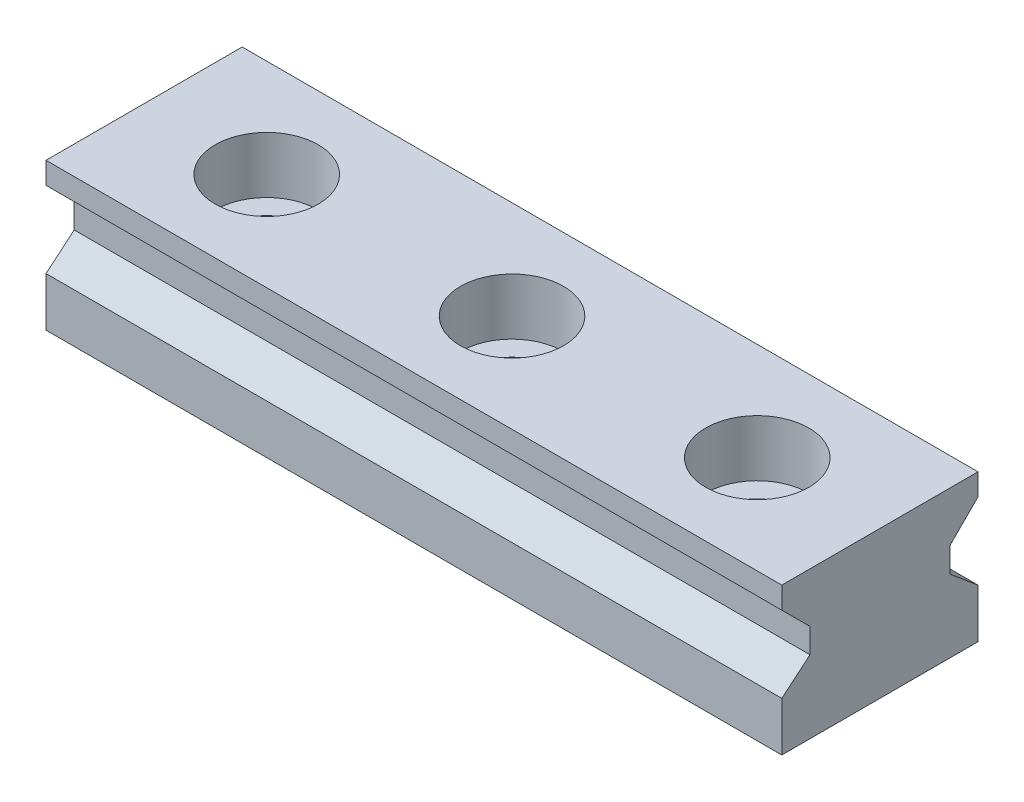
ISO-10303-21;
HEADER;
FILE_DESCRIPTION(('STEP AP214'),'2;1');
FILE_NAME('part.step','',(''),(''),'','','');
FILE_SCHEMA(('AUTOMOTIVE_DESIGN { 1 0 10303 214 1 1 1 1 }'));
ENDSEC;
DATA;
#1=APPLICATION_CONTEXT('core data for automotive mechanical design processes');
#2=APPLICATION_PROTOCOL_DEFINITION('international standard','automotive_design',2000,#1);
#3=PRODUCT_CONTEXT('',#1,'mechanical');
#4=PRODUCT('Part','Part','',(#3));
#5=PRODUCT_RELATED_PRODUCT_CATEGORY('part','',(#4));
#6=PRODUCT_DEFINITION_FORMATION('','',#4);
#7=PRODUCT_DEFINITION_CONTEXT('part definition',#1,'design');
#8=PRODUCT_DEFINITION('design','',#6,#7);
#9=PRODUCT_DEFINITION_SHAPE('','',#8);
#10=(LENGTH_UNIT() NAMED_UNIT(*) SI_UNIT(.MILLI.,.METRE.));
#11=(NAMED_UNIT(*) PLANE_ANGLE_UNIT() SI_UNIT($,.RADIAN.));
#12=(NAMED_UNIT(*) SI_UNIT($,.STERADIAN.) SOLID_ANGLE_UNIT());
#13=UNCERTAINTY_MEASURE_WITH_UNIT(LENGTH_MEASURE(1.E-05),#10,'distance_accuracy_value','');
#14=(GEOMETRIC_REPRESENTATION_CONTEXT(3) GLOBAL_UNCERTAINTY_ASSIGNED_CONTEXT((#13)) GLOBAL_UNIT_ASSIGNED_CONTEXT((#10,
#11,#12)) REPRESENTATION_CONTEXT('',''));
#15=CARTESIAN_POINT('',(0.,0.,0.));
#16=DIRECTION('',(0.,0.,1.));
#17=DIRECTION('',(1.,0.,0.));
#18=AXIS2_PLACEMENT_3D('',#15,#16,#17);
#19=CARTESIAN_POINT('',(-15.,5.114964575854,4.));
#20=DIRECTION('',(0.,-0.707106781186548,0.707106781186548));
#21=DIRECTION('',(0.,-0.707106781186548,-0.707106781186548));
#22=AXIS2_PLACEMENT_3D('',#19,#20,#21);
#23=PLANE('',#22);
#24=DIRECTION('',(1.,0.,0.));
#25=VECTOR('',#24,1.);
#26=CARTESIAN_POINT('',(-15.,5.114964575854,4.));
#27=LINE('',#26,#25);
#28=CARTESIAN_POINT('',(-15.,5.114964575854,4.));
#29=VERTEX_POINT('',#28);
#30=CARTESIAN_POINT('',(15.,5.114964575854,4.));
#31=VERTEX_POINT('',#30);
#32=EDGE_CURVE('E209',#29,#31,#27,.T.);
#33=ORIENTED_EDGE('',*,*,#32,.F.);
#34=DIRECTION('',(0.,-0.707106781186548,-0.707106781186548));
#35=VECTOR('',#34,1.);
#36=CARTESIAN_POINT('',(-15.,5.114964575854,4.));
#37=LINE('',#36,#35);
#38=CARTESIAN_POINT('',(-15.,3.964964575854,2.85));
#39=VERTEX_POINT('',#38);
#40=EDGE_CURVE('E117',#29,#39,#37,.T.);
#41=ORIENTED_EDGE('',*,*,#40,.T.);
#42=DIRECTION('',(1.,0.,0.));
#43=VECTOR('',#42,1.);
#44=CARTESIAN_POINT('',(-15.,3.964964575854,2.85));
#45=LINE('',#44,#43);
#46=CARTESIAN_POINT('',(15.,3.964964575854,2.85));
#47=VERTEX_POINT('',#46);
#48=EDGE_CURVE('E214',#47,#39,#45,.F.);
#49=ORIENTED_EDGE('',*,*,#48,.F.);
#50=DIRECTION('',(0.,-0.707106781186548,-0.707106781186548));
#51=VECTOR('',#50,1.);
#52=CARTESIAN_POINT('',(15.,5.114964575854,4.));
#53=LINE('',#52,#51);
#54=EDGE_CURVE('E136',#47,#31,#53,.F.);
#55=ORIENTED_EDGE('',*,*,#54,.T.);
#56=EDGE_LOOP('',(#33,#41,#49,#55));
#57=FACE_BOUND('',#56,.T.);
#58=ADVANCED_FACE('F16',(#57),#23,.T.);
#59=CARTESIAN_POINT('',(-15.,3.964964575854,-2.85));
#60=DIRECTION('',(0.,-0.707106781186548,-0.707106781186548));
#61=DIRECTION('',(0.,0.707106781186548,-0.707106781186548));
#62=AXIS2_PLACEMENT_3D('',#59,#60,#61);
#63=PLANE('',#62);
#64=DIRECTION('',(-1.,0.,0.));
#65=VECTOR('',#64,1.);
#66=CARTESIAN_POINT('',(-15.,3.964964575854,-2.85));
#67=LINE('',#66,#65);
#68=CARTESIAN_POINT('',(-15.,3.964964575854,-2.85));
#69=VERTEX_POINT('',#68);
#70=CARTESIAN_POINT('',(15.,3.964964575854,-2.85));
#71=VERTEX_POINT('',#70);
#72=EDGE_CURVE('E111',#69,#71,#67,.F.);
#73=ORIENTED_EDGE('',*,*,#72,.F.);
#74=DIRECTION('',(0.,0.707106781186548,-0.707106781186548));
#75=VECTOR('',#74,1.);
#76=CARTESIAN_POINT('',(-15.,3.964964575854,-2.85));
#77=LINE('',#76,#75);
#78=CARTESIAN_POINT('',(-15.,5.114964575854,-4.));
#79=VERTEX_POINT('',#78);
#80=EDGE_CURVE('E102',#69,#79,#77,.T.);
#81=ORIENTED_EDGE('',*,*,#80,.T.);
#82=DIRECTION('',(-1.,0.,0.));
#83=VECTOR('',#82,1.);
#84=CARTESIAN_POINT('',(-15.,5.114964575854,-4.));
#85=LINE('',#84,#83);
#86=CARTESIAN_POINT('',(15.,5.114964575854,-4.));
#87=VERTEX_POINT('',#86);
#88=EDGE_CURVE('E114',#87,#79,#85,.T.);
#89=ORIENTED_EDGE('',*,*,#88,.F.);
#90=DIRECTION('',(0.,0.707106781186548,-0.707106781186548));
#91=VECTOR('',#90,1.);
#92=CARTESIAN_POINT('',(15.,3.964964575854,-2.85));
#93=LINE('',#92,#91);
#94=EDGE_CURVE('E107',#87,#71,#93,.F.);
#95=ORIENTED_EDGE('',*,*,#94,.T.);
#96=EDGE_LOOP('',(#73,#81,#89,#95));
#97=FACE_BOUND('',#96,.T.);
#98=ADVANCED_FACE('F109',(#97),#63,.T.);
#99=CARTESIAN_POINT('',(-15.,2.964964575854,-2.85));
#100=DIRECTION('',(0.,0.,-1.));
#101=DIRECTION('',(-1.,0.,0.));
#102=AXIS2_PLACEMENT_3D('',#99,#100,#101);
#103=PLANE('',#102);
#104=DIRECTION('',(1.,0.,0.));
#105=VECTOR('',#104,1.);
#106=CARTESIAN_POINT('',(-15.,2.96496457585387,-2.84999999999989));
#107=LINE('',#106,#105);
#108=CARTESIAN_POINT('',(-15.,2.96496457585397,-2.84999999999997));
#109=VERTEX_POINT('',#108);
#110=CARTESIAN_POINT('',(15.,2.96496457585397,-2.84999999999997));
#111=VERTEX_POINT('',#110);
#112=EDGE_CURVE('E197',#109,#111,#107,.T.);
#113=ORIENTED_EDGE('',*,*,#112,.F.);
#114=DIRECTION('',(0.,1.,0.));
#115=VECTOR('',#114,1.);
#116=CARTESIAN_POINT('',(-15.,2.964964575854,-2.85));
#117=LINE('',#116,#115);
#118=EDGE_CURVE('E128',#109,#69,#117,.T.);
#119=ORIENTED_EDGE('',*,*,#118,.T.);
#120=ORIENTED_EDGE('',*,*,#72,.T.);
#121=DIRECTION('',(0.,1.,0.));
#122=VECTOR('',#121,1.);
#123=CARTESIAN_POINT('',(15.,2.964964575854,-2.85));
#124=LINE('',#123,#122);
#125=EDGE_CURVE('E120',#71,#111,#124,.F.);
#126=ORIENTED_EDGE('',*,*,#125,.T.);
#127=EDGE_LOOP('',(#113,#119,#120,#126));
#128=FACE_BOUND('',#127,.T.);
#129=ADVANCED_FACE('F130',(#128),#103,.T.);
#130=CARTESIAN_POINT('',(-15.,3.964964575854,2.85));
#131=DIRECTION('',(0.,0.,1.));
#132=DIRECTION('',(1.,0.,0.));
#133=AXIS2_PLACEMENT_3D('',#130,#131,#132);
#134=PLANE('',#133);
#135=ORIENTED_EDGE('',*,*,#48,.T.);
#136=DIRECTION('',(0.,1.,0.));
#137=VECTOR('',#136,1.);
#138=CARTESIAN_POINT('',(-15.,3.964964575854,2.85));
#139=LINE('',#138,#137);
#140=CARTESIAN_POINT('',(-15.,2.964964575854,2.85));
#141=VERTEX_POINT('',#140);
#142=EDGE_CURVE('E212',#39,#141,#139,.F.);
#143=ORIENTED_EDGE('',*,*,#142,.T.);
#144=DIRECTION('',(1.,0.,0.));
#145=VECTOR('',#144,1.);
#146=CARTESIAN_POINT('',(-15.,2.964964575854,2.85));
#147=LINE('',#146,#145);
#148=CARTESIAN_POINT('',(15.,2.964964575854,2.85));
#149=VERTEX_POINT('',#148);
#150=EDGE_CURVE('E190',#149,#141,#147,.F.);
#151=ORIENTED_EDGE('',*,*,#150,.F.);
#152=DIRECTION('',(0.,1.,0.));
#153=VECTOR('',#152,1.);
#154=CARTESIAN_POINT('',(15.,3.964964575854,2.85));
#155=LINE('',#154,#153);
#156=EDGE_CURVE('E217',#149,#47,#155,.T.);
#157=ORIENTED_EDGE('',*,*,#156,.T.);
#158=EDGE_LOOP('',(#135,#143,#151,#157));
#159=FACE_BOUND('',#158,.T.);
#160=ADVANCED_FACE('F221',(#159),#134,.T.);
#161=CARTESIAN_POINT('',(-15.,6.,4.));
#162=DIRECTION('',(0.,0.,1.));
#163=DIRECTION('',(1.,0.,0.));
#164=AXIS2_PLACEMENT_3D('',#161,#162,#163);
#165=PLANE('',#164);
#166=DIRECTION('',(1.,0.,0.));
#167=VECTOR('',#166,1.);
#168=CARTESIAN_POINT('',(-15.,6.,4.));
#169=LINE('',#168,#167);
#170=CARTESIAN_POINT('',(-15.,6.,4.));
#171=VERTEX_POINT('',#170);
#172=CARTESIAN_POINT('',(15.,6.,4.));
#173=VERTEX_POINT('',#172);
#174=EDGE_CURVE('E176',#171,#173,#169,.T.);
#175=ORIENTED_EDGE('',*,*,#174,.F.);
#176=DIRECTION('',(0.,1.,0.));
#177=VECTOR('',#176,1.);
#178=CARTESIAN_POINT('',(-15.,6.,4.));
#179=LINE('',#178,#177);
#180=EDGE_CURVE('E204',#171,#29,#179,.F.);
#181=ORIENTED_EDGE('',*,*,#180,.T.);
#182=ORIENTED_EDGE('',*,*,#32,.T.);
#183=DIRECTION('',(0.,1.,0.));
#184=VECTOR('',#183,1.);
#185=CARTESIAN_POINT('',(15.,6.,4.));
#186=LINE('',#185,#184);
#187=EDGE_CURVE('E207',#31,#173,#186,.T.);
#188=ORIENTED_EDGE('',*,*,#187,.T.);
#189=EDGE_LOOP('',(#175,#181,#182,#188));
#190=FACE_BOUND('',#189,.T.);
#191=ADVANCED_FACE('F322',(#190),#165,.T.);
#192=CARTESIAN_POINT('',(-15.,5.114964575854,-4.));
#193=DIRECTION('',(0.,0.,-1.));
#194=DIRECTION('',(-1.,0.,0.));
#195=AXIS2_PLACEMENT_3D('',#192,#193,#194);
#196=PLANE('',#195);
#197=ORIENTED_EDGE('',*,*,#88,.T.);
#198=DIRECTION('',(0.,1.,0.));
#199=VECTOR('',#198,1.);
#200=CARTESIAN_POINT('',(-15.,5.114964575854,-4.));
#201=LINE('',#200,#199);
#202=CARTESIAN_POINT('',(-15.,6.,-4.));
#203=VERTEX_POINT('',#202);
#204=EDGE_CURVE('E199',#79,#203,#201,.T.);
#205=ORIENTED_EDGE('',*,*,#204,.T.);
#206=DIRECTION('',(1.,0.,0.));
#207=VECTOR('',#206,1.);
#208=CARTESIAN_POINT('',(-15.,6.,-4.));
#209=LINE('',#208,#207);
#210=CARTESIAN_POINT('',(15.,6.,-4.));
#211=VERTEX_POINT('',#210);
#212=EDGE_CURVE('E172',#211,#203,#209,.F.);
#213=ORIENTED_EDGE('',*,*,#212,.F.);
#214=DIRECTION('',(0.,1.,0.));
#215=VECTOR('',#214,1.);
#216=CARTESIAN_POINT('',(15.,5.114964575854,-4.));
#217=LINE('',#216,#215);
#218=EDGE_CURVE('E202',#211,#87,#217,.F.);
#219=ORIENTED_EDGE('',*,*,#218,.T.);
#220=EDGE_LOOP('',(#197,#205,#213,#219));
#221=FACE_BOUND('',#220,.T.);
#222=ADVANCED_FACE('F313',(#221),#196,.T.);
#223=CARTESIAN_POINT('',(10.,-0.3,0.));
#224=DIRECTION('',(0.,1.,0.));
#225=DIRECTION('',(0.,0.,1.));
#226=AXIS2_PLACEMENT_3D('',#223,#224,#225);
#227=CYLINDRICAL_SURFACE('',#226,2.1);
#228=CARTESIAN_POINT('',(10.,3.7,0.));
#229=DIRECTION('',(0.,1.,0.));
#230=DIRECTION('',(0.,0.,1.));
#231=AXIS2_PLACEMENT_3D('',#228,#229,#230);
#232=CIRCLE('',#231,2.1);
#233=CARTESIAN_POINT('',(10.,3.7,2.1));
#234=VERTEX_POINT('',#233);
#235=EDGE_CURVE('E162',#234,#234,#232,.T.);
#236=ORIENTED_EDGE('',*,*,#235,.F.);
#237=EDGE_LOOP('',(#236));
#238=FACE_BOUND('',#237,.T.);
#239=CARTESIAN_POINT('',(10.,6.,0.));
#240=DIRECTION('',(0.,1.,0.));
#241=DIRECTION('',(0.,0.,1.));
#242=AXIS2_PLACEMENT_3D('',#239,#240,#241);
#243=CIRCLE('',#242,2.1);
#244=CARTESIAN_POINT('',(10.,6.,2.1));
#245=VERTEX_POINT('',#244);
#246=EDGE_CURVE('E19',#245,#245,#243,.F.);
#247=ORIENTED_EDGE('',*,*,#246,.F.);
#248=EDGE_LOOP('',(#247));
#249=FACE_BOUND('',#248,.T.);
#250=ADVANCED_FACE('F309',(#238,#249),#227,.F.);
#251=CARTESIAN_POINT('',(0.,-0.3,0.));
#252=DIRECTION('',(0.,1.,0.));
#253=DIRECTION('',(0.,0.,1.));
#254=AXIS2_PLACEMENT_3D('',#251,#252,#253);
#255=CYLINDRICAL_SURFACE('',#254,2.1);
#256=CARTESIAN_POINT('',(0.,3.7,0.));
#257=DIRECTION('',(0.,1.,0.));
#258=DIRECTION('',(0.,0.,1.));
#259=AXIS2_PLACEMENT_3D('',#256,#257,#258);
#260=CIRCLE('',#259,2.1);
#261=CARTESIAN_POINT('',(0.,3.7,2.1));
#262=VERTEX_POINT('',#261);
#263=EDGE_CURVE('E159',#262,#262,#260,.T.);
#264=ORIENTED_EDGE('',*,*,#263,.F.);
#265=EDGE_LOOP('',(#264));
#266=FACE_BOUND('',#265,.T.);
#267=CARTESIAN_POINT('',(0.,6.,0.));
#268=DIRECTION('',(0.,1.,0.));
#269=DIRECTION('',(0.,0.,1.));
#270=AXIS2_PLACEMENT_3D('',#267,#268,#269);
#271=CIRCLE('',#270,2.1);
#272=CARTESIAN_POINT('',(0.,6.,2.1));
#273=VERTEX_POINT('',#272);
#274=EDGE_CURVE('E167',#273,#273,#271,.F.);
#275=ORIENTED_EDGE('',*,*,#274,.F.);
#276=EDGE_LOOP('',(#275));
#277=FACE_BOUND('',#276,.T.);
#278=ADVANCED_FACE('F312',(#266,#277),#255,.F.);
#279=CARTESIAN_POINT('',(-10.,-0.3,0.));
#280=DIRECTION('',(0.,1.,0.));
#281=DIRECTION('',(0.,0.,1.));
#282=AXIS2_PLACEMENT_3D('',#279,#280,#281);
#283=CYLINDRICAL_SURFACE('',#282,2.1);
#284=CARTESIAN_POINT('',(-10.,3.7,0.));
#285=DIRECTION('',(0.,1.,0.));
#286=DIRECTION('',(0.,0.,1.));
#287=AXIS2_PLACEMENT_3D('',#284,#285,#286);
#288=CIRCLE('',#287,2.1);
#289=CARTESIAN_POINT('',(-10.,3.7,2.1));
#290=VERTEX_POINT('',#289);
#291=EDGE_CURVE('E155',#290,#290,#288,.T.);
#292=ORIENTED_EDGE('',*,*,#291,.F.);
#293=EDGE_LOOP('',(#292));
#294=FACE_BOUND('',#293,.T.);
#295=CARTESIAN_POINT('',(-10.,6.,0.));
#296=DIRECTION('',(0.,1.,0.));
#297=DIRECTION('',(0.,0.,1.));
#298=AXIS2_PLACEMENT_3D('',#295,#296,#297);
#299=CIRCLE('',#298,2.1);
#300=CARTESIAN_POINT('',(-10.,6.,2.1));
#301=VERTEX_POINT('',#300);
#302=EDGE_CURVE('E165',#301,#301,#299,.F.);
#303=ORIENTED_EDGE('',*,*,#302,.F.);
#304=EDGE_LOOP('',(#303));
#305=FACE_BOUND('',#304,.T.);
#306=ADVANCED_FACE('F319',(#294,#305),#283,.F.);
#307=CARTESIAN_POINT('',(-15.,2.,-4.));
#308=DIRECTION('',(0.,0.766044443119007,-0.642787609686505));
#309=DIRECTION('',(0.,0.642787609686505,0.766044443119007));
#310=AXIS2_PLACEMENT_3D('',#307,#308,#309);
#311=PLANE('',#310);
#312=DIRECTION('',(-1.,0.,0.));
#313=VECTOR('',#312,1.);
#314=CARTESIAN_POINT('',(-15.,2.,-4.));
#315=LINE('',#314,#313);
#316=CARTESIAN_POINT('',(-15.,2.,-4.));
#317=VERTEX_POINT('',#316);
#318=CARTESIAN_POINT('',(15.,2.,-4.));
#319=VERTEX_POINT('',#318);
#320=EDGE_CURVE('E158',#317,#319,#315,.F.);
#321=ORIENTED_EDGE('',*,*,#320,.F.);
#322=DIRECTION('',(0.,0.642787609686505,0.766044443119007));
#323=VECTOR('',#322,1.);
#324=CARTESIAN_POINT('',(-15.,2.,-4.));
#325=LINE('',#324,#323);
#326=EDGE_CURVE('E193',#317,#109,#325,.T.);
#327=ORIENTED_EDGE('',*,*,#326,.T.);
#328=ORIENTED_EDGE('',*,*,#112,.T.);
#329=DIRECTION('',(0.,0.642787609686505,0.766044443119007));
#330=VECTOR('',#329,1.);
#331=CARTESIAN_POINT('',(15.,2.,-4.));
#332=LINE('',#331,#330);
#333=EDGE_CURVE('E124',#111,#319,#332,.F.);
#334=ORIENTED_EDGE('',*,*,#333,.T.);
#335=EDGE_LOOP('',(#321,#327,#328,#334));
#336=FACE_BOUND('',#335,.T.);
#337=ADVANCED_FACE('F391',(#336),#311,.T.);
#338=CARTESIAN_POINT('',(-15.,2.964964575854,2.85));
#339=DIRECTION('',(0.,0.766044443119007,0.642787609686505));
#340=DIRECTION('',(0.,-0.642787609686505,0.766044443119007));
#341=AXIS2_PLACEMENT_3D('',#338,#339,#340);
#342=PLANE('',#341);
#343=ORIENTED_EDGE('',*,*,#150,.T.);
#344=DIRECTION('',(0.,-0.642787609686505,0.766044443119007));
#345=VECTOR('',#344,1.);
#346=CARTESIAN_POINT('',(-15.,2.964964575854,2.85));
#347=LINE('',#346,#345);
#348=CARTESIAN_POINT('',(-15.,2.00000000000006,4.00000000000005));
#349=VERTEX_POINT('',#348);
#350=EDGE_CURVE('E184',#141,#349,#347,.T.);
#351=ORIENTED_EDGE('',*,*,#350,.T.);
#352=DIRECTION('',(1.,0.,0.));
#353=VECTOR('',#352,1.);
#354=CARTESIAN_POINT('',(-15.,2.,4.));
#355=LINE('',#354,#353);
#356=CARTESIAN_POINT('',(15.,2.00000000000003,4.00000000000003));
#357=VERTEX_POINT('',#356);
#358=EDGE_CURVE('E234',#357,#349,#355,.F.);
#359=ORIENTED_EDGE('',*,*,#358,.F.);
#360=DIRECTION('',(0.,-0.64278760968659,0.766044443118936));
#361=VECTOR('',#360,1.);
#362=CARTESIAN_POINT('',(15.,2.964964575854,2.85));
#363=LINE('',#362,#361);
#364=EDGE_CURVE('E224',#149,#357,#363,.T.);
#365=ORIENTED_EDGE('',*,*,#364,.F.);
#366=EDGE_LOOP('',(#343,#351,#359,#365));
#367=FACE_BOUND('',#366,.T.);
#368=ADVANCED_FACE('F233',(#367),#342,.T.);
#369=CARTESIAN_POINT('',(-15.,6.,-4.));
#370=DIRECTION('',(0.,1.,0.));
#371=DIRECTION('',(0.,0.,1.));
#372=AXIS2_PLACEMENT_3D('',#369,#370,#371);
#373=PLANE('',#372);
#374=ORIENTED_EDGE('',*,*,#302,.T.);
#375=EDGE_LOOP('',(#374));
#376=FACE_BOUND('',#375,.T.);
#377=ORIENTED_EDGE('',*,*,#274,.T.);
#378=EDGE_LOOP('',(#377));
#379=FACE_BOUND('',#378,.T.);
#380=ORIENTED_EDGE('',*,*,#246,.T.);
#381=EDGE_LOOP('',(#380));
#382=FACE_BOUND('',#381,.T.);
#383=ORIENTED_EDGE('',*,*,#212,.T.);
#384=DIRECTION('',(0.,0.,-1.));
#385=VECTOR('',#384,1.);
#386=CARTESIAN_POINT('',(-15.,6.,0.));
#387=LINE('',#386,#385);
#388=EDGE_CURVE('E154',#203,#171,#387,.F.);
#389=ORIENTED_EDGE('',*,*,#388,.T.);
#390=ORIENTED_EDGE('',*,*,#174,.T.);
#391=DIRECTION('',(0.,0.,-1.));
#392=VECTOR('',#391,1.);
#393=CARTESIAN_POINT('',(15.,6.,0.));
#394=LINE('',#393,#392);
#395=EDGE_CURVE('E237',#211,#173,#394,.F.);
#396=ORIENTED_EDGE('',*,*,#395,.F.);
#397=EDGE_LOOP('',(#383,#389,#390,#396));
#398=FACE_BOUND('',#397,.T.);
#399=ADVANCED_FACE('F305',(#376,#379,#382,#398),#373,.T.);
#400=CARTESIAN_POINT('',(10.,3.7,0.));
#401=DIRECTION('',(0.,1.,0.));
#402=DIRECTION('',(0.,0.,1.));
#403=AXIS2_PLACEMENT_3D('',#400,#401,#402);
#404=PLANE('',#403);
#405=CARTESIAN_POINT('',(10.,3.7,0.));
#406=DIRECTION('',(0.,1.,0.));
#407=DIRECTION('',(0.,0.,1.));
#408=AXIS2_PLACEMENT_3D('',#405,#406,#407);
#409=CIRCLE('',#408,1.2);
#410=CARTESIAN_POINT('',(10.,3.7,1.2));
#411=VERTEX_POINT('',#410);
#412=EDGE_CURVE('E151',#411,#411,#409,.F.);
#413=ORIENTED_EDGE('',*,*,#412,.T.);
#414=EDGE_LOOP('',(#413));
#415=FACE_BOUND('',#414,.T.);
#416=ORIENTED_EDGE('',*,*,#235,.T.);
#417=EDGE_LOOP('',(#416));
#418=FACE_BOUND('',#417,.T.);
#419=ADVANCED_FACE('F301',(#415,#418),#404,.T.);
#420=CARTESIAN_POINT('',(0.,3.7,0.));
#421=DIRECTION('',(0.,1.,0.));
#422=DIRECTION('',(0.,0.,1.));
#423=AXIS2_PLACEMENT_3D('',#420,#421,#422);
#424=PLANE('',#423);
#425=CARTESIAN_POINT('',(0.,3.7,0.));
#426=DIRECTION('',(0.,1.,0.));
#427=DIRECTION('',(0.,0.,1.));
#428=AXIS2_PLACEMENT_3D('',#425,#426,#427);
#429=CIRCLE('',#428,1.2);
#430=CARTESIAN_POINT('',(0.,3.7,1.2));
#431=VERTEX_POINT('',#430);
#432=EDGE_CURVE('E148',#431,#431,#429,.F.);
#433=ORIENTED_EDGE('',*,*,#432,.T.);
#434=EDGE_LOOP('',(#433));
#435=FACE_BOUND('',#434,.T.);
#436=ORIENTED_EDGE('',*,*,#263,.T.);
#437=EDGE_LOOP('',(#436));
#438=FACE_BOUND('',#437,.T.);
#439=ADVANCED_FACE('F304',(#435,#438),#424,.T.);
#440=CARTESIAN_POINT('',(-10.,3.7,0.));
#441=DIRECTION('',(0.,1.,0.));
#442=DIRECTION('',(0.,0.,1.));
#443=AXIS2_PLACEMENT_3D('',#440,#441,#442);
#444=PLANE('',#443);
#445=CARTESIAN_POINT('',(-10.,3.7,0.));
#446=DIRECTION('',(0.,1.,0.));
#447=DIRECTION('',(0.,0.,1.));
#448=AXIS2_PLACEMENT_3D('',#445,#446,#447);
#449=CIRCLE('',#448,1.2);
#450=CARTESIAN_POINT('',(-10.,3.7,1.2));
#451=VERTEX_POINT('',#450);
#452=EDGE_CURVE('E144',#451,#451,#449,.F.);
#453=ORIENTED_EDGE('',*,*,#452,.T.);
#454=EDGE_LOOP('',(#453));
#455=FACE_BOUND('',#454,.T.);
#456=ORIENTED_EDGE('',*,*,#291,.T.);
#457=EDGE_LOOP('',(#456));
#458=FACE_BOUND('',#457,.T.);
#459=ADVANCED_FACE('F432',(#455,#458),#444,.T.);
#460=CARTESIAN_POINT('',(-15.,0.,-4.));
#461=DIRECTION('',(0.,0.,-1.));
#462=DIRECTION('',(-1.,0.,0.));
#463=AXIS2_PLACEMENT_3D('',#460,#461,#462);
#464=PLANE('',#463);
#465=DIRECTION('',(1.,0.,0.));
#466=VECTOR('',#465,1.);
#467=CARTESIAN_POINT('',(-15.,0.,-4.));
#468=LINE('',#467,#466);
#469=CARTESIAN_POINT('',(-15.,0.,-4.));
#470=VERTEX_POINT('',#469);
#471=CARTESIAN_POINT('',(15.,0.,-4.));
#472=VERTEX_POINT('',#471);
#473=EDGE_CURVE('E147',#470,#472,#468,.T.);
#474=ORIENTED_EDGE('',*,*,#473,.F.);
#475=DIRECTION('',(0.,1.,0.));
#476=VECTOR('',#475,1.);
#477=CARTESIAN_POINT('',(-15.,0.,-4.));
#478=LINE('',#477,#476);
#479=EDGE_CURVE('E246',#470,#317,#478,.T.);
#480=ORIENTED_EDGE('',*,*,#479,.T.);
#481=ORIENTED_EDGE('',*,*,#320,.T.);
#482=DIRECTION('',(0.,1.,0.));
#483=VECTOR('',#482,1.);
#484=CARTESIAN_POINT('',(15.,0.,-4.));
#485=LINE('',#484,#483);
#486=EDGE_CURVE('E236',#472,#319,#485,.T.);
#487=ORIENTED_EDGE('',*,*,#486,.F.);
#488=EDGE_LOOP('',(#474,#480,#481,#487));
#489=FACE_BOUND('',#488,.T.);
#490=ADVANCED_FACE('F264',(#489),#464,.T.);
#491=CARTESIAN_POINT('',(15.,0.,0.));
#492=DIRECTION('',(1.,0.,0.));
#493=DIRECTION('',(0.,0.,-1.));
#494=AXIS2_PLACEMENT_3D('',#491,#492,#493);
#495=PLANE('',#494);
#496=ORIENTED_EDGE('',*,*,#395,.T.);
#497=ORIENTED_EDGE('',*,*,#187,.F.);
#498=ORIENTED_EDGE('',*,*,#54,.F.);
#499=ORIENTED_EDGE('',*,*,#156,.F.);
#500=ORIENTED_EDGE('',*,*,#364,.T.);
#501=DIRECTION('',(0.,1.,0.));
#502=VECTOR('',#501,1.);
#503=CARTESIAN_POINT('',(15.,2.,4.));
#504=LINE('',#503,#502);
#505=CARTESIAN_POINT('',(15.,0.,4.));
#506=VERTEX_POINT('',#505);
#507=EDGE_CURVE('E242',#506,#357,#504,.T.);
#508=ORIENTED_EDGE('',*,*,#507,.F.);
#509=DIRECTION('',(0.,0.,-1.));
#510=VECTOR('',#509,1.);
#511=CARTESIAN_POINT('',(15.,0.,4.));
#512=LINE('',#511,#510);
#513=EDGE_CURVE('E252',#472,#506,#512,.F.);
#514=ORIENTED_EDGE('',*,*,#513,.F.);
#515=ORIENTED_EDGE('',*,*,#486,.T.);
#516=ORIENTED_EDGE('',*,*,#333,.F.);
#517=ORIENTED_EDGE('',*,*,#125,.F.);
#518=ORIENTED_EDGE('',*,*,#94,.F.);
#519=ORIENTED_EDGE('',*,*,#218,.F.);
#520=EDGE_LOOP('',(#496,#497,#498,#499,#500,#508,#514,#515,#516,#517,#518,#519));
#521=FACE_BOUND('',#520,.T.);
#522=ADVANCED_FACE('F122',(#521),#495,.T.);
#523=CARTESIAN_POINT('',(-15.,2.,4.));
#524=DIRECTION('',(0.,0.,1.));
#525=DIRECTION('',(1.,0.,0.));
#526=AXIS2_PLACEMENT_3D('',#523,#524,#525);
#527=PLANE('',#526);
#528=ORIENTED_EDGE('',*,*,#358,.T.);
#529=DIRECTION('',(0.,1.,0.));
#530=VECTOR('',#529,1.);
#531=CARTESIAN_POINT('',(-15.,0.,4.));
#532=LINE('',#531,#530);
#533=CARTESIAN_POINT('',(-15.,0.,4.));
#534=VERTEX_POINT('',#533);
#535=EDGE_CURVE('E34',#349,#534,#532,.F.);
#536=ORIENTED_EDGE('',*,*,#535,.T.);
#537=DIRECTION('',(1.,0.,0.));
#538=VECTOR('',#537,1.);
#539=CARTESIAN_POINT('',(-15.,0.,4.));
#540=LINE('',#539,#538);
#541=EDGE_CURVE('E255',#506,#534,#540,.F.);
#542=ORIENTED_EDGE('',*,*,#541,.F.);
#543=ORIENTED_EDGE('',*,*,#507,.T.);
#544=EDGE_LOOP('',(#528,#536,#542,#543));
#545=FACE_BOUND('',#544,.T.);
#546=ADVANCED_FACE('F266',(#545),#527,.T.);
#547=CARTESIAN_POINT('',(-15.,0.,0.));
#548=DIRECTION('',(1.,0.,0.));
#549=DIRECTION('',(0.,0.,-1.));
#550=AXIS2_PLACEMENT_3D('',#547,#548,#549);
#551=PLANE('',#550);
#552=ORIENTED_EDGE('',*,*,#204,.F.);
#553=ORIENTED_EDGE('',*,*,#80,.F.);
#554=ORIENTED_EDGE('',*,*,#118,.F.);
#555=ORIENTED_EDGE('',*,*,#326,.F.);
#556=ORIENTED_EDGE('',*,*,#479,.F.);
#557=DIRECTION('',(0.,0.,-1.));
#558=VECTOR('',#557,1.);
#559=CARTESIAN_POINT('',(-15.,0.,4.));
#560=LINE('',#559,#558);
#561=EDGE_CURVE('E143',#534,#470,#560,.T.);
#562=ORIENTED_EDGE('',*,*,#561,.F.);
#563=ORIENTED_EDGE('',*,*,#535,.F.);
#564=ORIENTED_EDGE('',*,*,#350,.F.);
#565=ORIENTED_EDGE('',*,*,#142,.F.);
#566=ORIENTED_EDGE('',*,*,#40,.F.);
#567=ORIENTED_EDGE('',*,*,#180,.F.);
#568=ORIENTED_EDGE('',*,*,#388,.F.);
#569=EDGE_LOOP('',(#552,#553,#554,#555,#556,#562,#563,#564,#565,#566,#567,#568));
#570=FACE_BOUND('',#569,.T.);
#571=ADVANCED_FACE('F231',(#570),#551,.F.);
#572=CARTESIAN_POINT('',(10.,-0.3,0.));
#573=DIRECTION('',(0.,1.,0.));
#574=DIRECTION('',(0.,0.,1.));
#575=AXIS2_PLACEMENT_3D('',#572,#573,#574);
#576=CYLINDRICAL_SURFACE('',#575,1.2);
#577=ORIENTED_EDGE('',*,*,#412,.F.);
#578=EDGE_LOOP('',(#577));
#579=FACE_BOUND('',#578,.T.);
#580=CARTESIAN_POINT('',(10.,0.,0.));
#581=DIRECTION('',(0.,1.,0.));
#582=DIRECTION('',(0.,0.,1.));
#583=AXIS2_PLACEMENT_3D('',#580,#581,#582);
#584=CIRCLE('',#583,1.2);
#585=CARTESIAN_POINT('',(10.,0.,1.2));
#586=VERTEX_POINT('',#585);
#587=EDGE_CURVE('E140',#586,#586,#584,.T.);
#588=ORIENTED_EDGE('',*,*,#587,.F.);
#589=EDGE_LOOP('',(#588));
#590=FACE_BOUND('',#589,.T.);
#591=ADVANCED_FACE('F274',(#579,#590),#576,.F.);
#592=CARTESIAN_POINT('',(0.,-0.3,0.));
#593=DIRECTION('',(0.,1.,0.));
#594=DIRECTION('',(0.,0.,1.));
#595=AXIS2_PLACEMENT_3D('',#592,#593,#594);
#596=CYLINDRICAL_SURFACE('',#595,1.2);
#597=ORIENTED_EDGE('',*,*,#432,.F.);
#598=EDGE_LOOP('',(#597));
#599=FACE_BOUND('',#598,.T.);
#600=CARTESIAN_POINT('',(0.,0.,0.));
#601=DIRECTION('',(0.,1.,0.));
#602=DIRECTION('',(0.,0.,1.));
#603=AXIS2_PLACEMENT_3D('',#600,#601,#602);
#604=CIRCLE('',#603,1.2);
#605=CARTESIAN_POINT('',(0.,0.,1.2));
#606=VERTEX_POINT('',#605);
#607=EDGE_CURVE('E25',#606,#606,#604,.T.);
#608=ORIENTED_EDGE('',*,*,#607,.F.);
#609=EDGE_LOOP('',(#608));
#610=FACE_BOUND('',#609,.T.);
#611=ADVANCED_FACE('F284',(#599,#610),#596,.F.);
#612=CARTESIAN_POINT('',(-10.,-0.3,0.));
#613=DIRECTION('',(0.,1.,0.));
#614=DIRECTION('',(0.,0.,1.));
#615=AXIS2_PLACEMENT_3D('',#612,#613,#614);
#616=CYLINDRICAL_SURFACE('',#615,1.2);
#617=ORIENTED_EDGE('',*,*,#452,.F.);
#618=EDGE_LOOP('',(#617));
#619=FACE_BOUND('',#618,.T.);
#620=CARTESIAN_POINT('',(-10.,0.,0.));
#621=DIRECTION('',(0.,1.,0.));
#622=DIRECTION('',(0.,0.,1.));
#623=AXIS2_PLACEMENT_3D('',#620,#621,#622);
#624=CIRCLE('',#623,1.2);
#625=CARTESIAN_POINT('',(-10.,0.,1.2));
#626=VERTEX_POINT('',#625);
#627=EDGE_CURVE('E11',#626,#626,#624,.T.);
#628=ORIENTED_EDGE('',*,*,#627,.F.);
#629=EDGE_LOOP('',(#628));
#630=FACE_BOUND('',#629,.T.);
#631=ADVANCED_FACE('F278',(#619,#630),#616,.F.);
#632=CARTESIAN_POINT('',(-15.,0.,4.));
#633=DIRECTION('',(0.,-1.,0.));
#634=DIRECTION('',(0.,0.,-1.));
#635=AXIS2_PLACEMENT_3D('',#632,#633,#634);
#636=PLANE('',#635);
#637=ORIENTED_EDGE('',*,*,#627,.T.);
#638=EDGE_LOOP('',(#637));
#639=FACE_BOUND('',#638,.T.);
#640=ORIENTED_EDGE('',*,*,#607,.T.);
#641=EDGE_LOOP('',(#640));
#642=FACE_BOUND('',#641,.T.);
#643=ORIENTED_EDGE('',*,*,#587,.T.);
#644=EDGE_LOOP('',(#643));
#645=FACE_BOUND('',#644,.T.);
#646=ORIENTED_EDGE('',*,*,#541,.T.);
#647=ORIENTED_EDGE('',*,*,#561,.T.);
#648=ORIENTED_EDGE('',*,*,#473,.T.);
#649=ORIENTED_EDGE('',*,*,#513,.T.);
#650=EDGE_LOOP('',(#646,#647,#648,#649));
#651=FACE_BOUND('',#650,.T.);
#652=ADVANCED_FACE('F260',(#639,#642,#645,#651),#636,.T.);
#653=CLOSED_SHELL('',(#58,#98,#129,#160,#191,#222,#250,#278,#306,#337,#368,#399,#419,#439,#459,
#490,#522,#546,#571,#591,#611,#631,#652));
#654=MANIFOLD_SOLID_BREP('B1',#653);
#655=ADVANCED_BREP_SHAPE_REPRESENTATION('',(#18,#654),#14);
#656=SHAPE_DEFINITION_REPRESENTATION(#9,#655);
ENDSEC;
END-ISO-10303-21;
